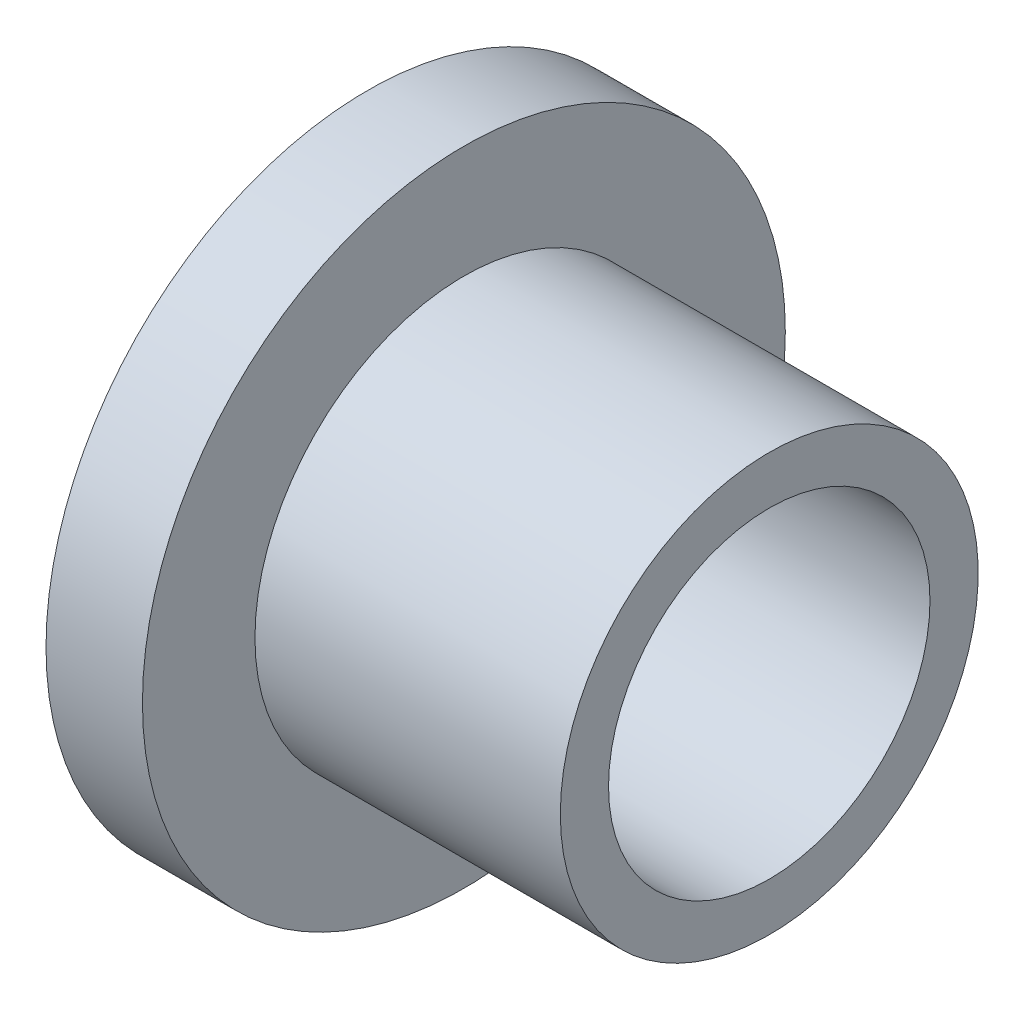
ISO-10303-21;
HEADER;
FILE_DESCRIPTION(('STEP AP214'),'2;1');
FILE_NAME('part.step','',(''),(''),'','','');
FILE_SCHEMA(('AUTOMOTIVE_DESIGN { 1 0 10303 214 1 1 1 1 }'));
ENDSEC;
DATA;
#1=APPLICATION_CONTEXT('core data for automotive mechanical design processes');
#2=APPLICATION_PROTOCOL_DEFINITION('international standard','automotive_design',2000,#1);
#3=PRODUCT_CONTEXT('',#1,'mechanical');
#4=PRODUCT('Part','Part','',(#3));
#5=PRODUCT_RELATED_PRODUCT_CATEGORY('part','',(#4));
#6=PRODUCT_DEFINITION_FORMATION('','',#4);
#7=PRODUCT_DEFINITION_CONTEXT('part definition',#1,'design');
#8=PRODUCT_DEFINITION('design','',#6,#7);
#9=PRODUCT_DEFINITION_SHAPE('','',#8);
#10=(LENGTH_UNIT() NAMED_UNIT(*) SI_UNIT(.MILLI.,.METRE.));
#11=(NAMED_UNIT(*) PLANE_ANGLE_UNIT() SI_UNIT($,.RADIAN.));
#12=(NAMED_UNIT(*) SI_UNIT($,.STERADIAN.) SOLID_ANGLE_UNIT());
#13=UNCERTAINTY_MEASURE_WITH_UNIT(LENGTH_MEASURE(1.E-05),#10,'distance_accuracy_value','');
#14=(GEOMETRIC_REPRESENTATION_CONTEXT(3) GLOBAL_UNCERTAINTY_ASSIGNED_CONTEXT((#13)) GLOBAL_UNIT_ASSIGNED_CONTEXT((#10,
#11,#12)) REPRESENTATION_CONTEXT('',''));
#15=CARTESIAN_POINT('',(0.,0.,0.));
#16=DIRECTION('',(0.,0.,1.));
#17=DIRECTION('',(1.,0.,0.));
#18=AXIS2_PLACEMENT_3D('',#15,#16,#17);
#19=CARTESIAN_POINT('',(0.,2.54,0.));
#20=DIRECTION('',(1.,0.,0.));
#21=DIRECTION('',(0.,1.,0.));
#22=AXIS2_PLACEMENT_3D('',#19,#20,#21);
#23=PLANE('',#22);
#24=CARTESIAN_POINT('',(0.,0.,0.));
#25=DIRECTION('',(-1.,0.,0.));
#26=DIRECTION('',(0.,0.,1.));
#27=AXIS2_PLACEMENT_3D('',#24,#25,#26);
#28=CIRCLE('',#27,2.54);
#29=CARTESIAN_POINT('',(0.,0.,2.54));
#30=VERTEX_POINT('',#29);
#31=EDGE_CURVE('E43',#30,#30,#28,.T.);
#32=ORIENTED_EDGE('',*,*,#31,.F.);
#33=EDGE_LOOP('',(#32));
#34=FACE_BOUND('',#33,.T.);
#35=CARTESIAN_POINT('',(0.,0.,0.));
#36=DIRECTION('',(-1.,0.,0.));
#37=DIRECTION('',(0.,0.,1.));
#38=AXIS2_PLACEMENT_3D('',#35,#36,#37);
#39=CIRCLE('',#38,5.08);
#40=CARTESIAN_POINT('',(0.,0.,5.08));
#41=VERTEX_POINT('',#40);
#42=EDGE_CURVE('E10',#41,#41,#39,.T.);
#43=ORIENTED_EDGE('',*,*,#42,.T.);
#44=EDGE_LOOP('',(#43));
#45=FACE_BOUND('',#44,.T.);
#46=ADVANCED_FACE('F15',(#34,#45),#23,.F.);
#47=CARTESIAN_POINT('',(6.35,3.302,0.));
#48=DIRECTION('',(-1.,0.,0.));
#49=DIRECTION('',(0.,0.,1.));
#50=AXIS2_PLACEMENT_3D('',#47,#48,#49);
#51=PLANE('',#50);
#52=CARTESIAN_POINT('',(6.35000000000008,0.,0.));
#53=DIRECTION('',(-1.,0.,0.));
#54=DIRECTION('',(0.,0.,1.));
#55=AXIS2_PLACEMENT_3D('',#52,#53,#54);
#56=CIRCLE('',#55,2.54);
#57=CARTESIAN_POINT('',(6.35000000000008,0.,2.54));
#58=VERTEX_POINT('',#57);
#59=EDGE_CURVE('E53',#58,#58,#56,.T.);
#60=ORIENTED_EDGE('',*,*,#59,.T.);
#61=EDGE_LOOP('',(#60));
#62=FACE_BOUND('',#61,.T.);
#63=CARTESIAN_POINT('',(6.35000000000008,0.,0.));
#64=DIRECTION('',(-1.,0.,0.));
#65=DIRECTION('',(0.,0.,1.));
#66=AXIS2_PLACEMENT_3D('',#63,#64,#65);
#67=CIRCLE('',#66,3.302);
#68=CARTESIAN_POINT('',(6.35000000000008,0.,3.302));
#69=VERTEX_POINT('',#68);
#70=EDGE_CURVE('E40',#69,#69,#67,.T.);
#71=ORIENTED_EDGE('',*,*,#70,.F.);
#72=EDGE_LOOP('',(#71));
#73=FACE_BOUND('',#72,.T.);
#74=ADVANCED_FACE('F64',(#62,#73),#51,.F.);
#75=CARTESIAN_POINT('',(1.524,5.08,0.));
#76=DIRECTION('',(-1.,0.,0.));
#77=DIRECTION('',(0.,0.,1.));
#78=AXIS2_PLACEMENT_3D('',#75,#76,#77);
#79=PLANE('',#78);
#80=CARTESIAN_POINT('',(1.52400000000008,0.,0.));
#81=DIRECTION('',(-1.,0.,0.));
#82=DIRECTION('',(0.,0.,1.));
#83=AXIS2_PLACEMENT_3D('',#80,#81,#82);
#84=CIRCLE('',#83,3.302);
#85=CARTESIAN_POINT('',(1.52400000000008,0.,3.302));
#86=VERTEX_POINT('',#85);
#87=EDGE_CURVE('E32',#86,#86,#84,.T.);
#88=ORIENTED_EDGE('',*,*,#87,.T.);
#89=EDGE_LOOP('',(#88));
#90=FACE_BOUND('',#89,.T.);
#91=CARTESIAN_POINT('',(1.52400000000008,0.,0.));
#92=DIRECTION('',(-1.,0.,0.));
#93=DIRECTION('',(0.,0.,1.));
#94=AXIS2_PLACEMENT_3D('',#91,#92,#93);
#95=CIRCLE('',#94,5.08);
#96=CARTESIAN_POINT('',(1.52400000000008,0.,5.08));
#97=VERTEX_POINT('',#96);
#98=EDGE_CURVE('E23',#97,#97,#95,.T.);
#99=ORIENTED_EDGE('',*,*,#98,.F.);
#100=EDGE_LOOP('',(#99));
#101=FACE_BOUND('',#100,.T.);
#102=ADVANCED_FACE('F17',(#90,#101),#79,.F.);
#103=CARTESIAN_POINT('',(-1000.,0.,0.));
#104=DIRECTION('',(-1.,0.,0.));
#105=DIRECTION('',(0.,0.,1.));
#106=AXIS2_PLACEMENT_3D('',#103,#104,#105);
#107=CYLINDRICAL_SURFACE('',#106,5.08);
#108=ORIENTED_EDGE('',*,*,#42,.F.);
#109=EDGE_LOOP('',(#108));
#110=FACE_BOUND('',#109,.T.);
#111=ORIENTED_EDGE('',*,*,#98,.T.);
#112=EDGE_LOOP('',(#111));
#113=FACE_BOUND('',#112,.T.);
#114=ADVANCED_FACE('F75',(#110,#113),#107,.T.);
#115=CARTESIAN_POINT('',(-1000.,0.,0.));
#116=DIRECTION('',(-1.,0.,0.));
#117=DIRECTION('',(0.,0.,1.));
#118=AXIS2_PLACEMENT_3D('',#115,#116,#117);
#119=CYLINDRICAL_SURFACE('',#118,3.302);
#120=ORIENTED_EDGE('',*,*,#87,.F.);
#121=EDGE_LOOP('',(#120));
#122=FACE_BOUND('',#121,.T.);
#123=ORIENTED_EDGE('',*,*,#70,.T.);
#124=EDGE_LOOP('',(#123));
#125=FACE_BOUND('',#124,.T.);
#126=ADVANCED_FACE('F69',(#122,#125),#119,.T.);
#127=CARTESIAN_POINT('',(-1000.,0.,0.));
#128=DIRECTION('',(-1.,0.,0.));
#129=DIRECTION('',(0.,0.,1.));
#130=AXIS2_PLACEMENT_3D('',#127,#128,#129);
#131=CYLINDRICAL_SURFACE('',#130,2.54);
#132=ORIENTED_EDGE('',*,*,#31,.T.);
#133=EDGE_LOOP('',(#132));
#134=FACE_BOUND('',#133,.T.);
#135=ORIENTED_EDGE('',*,*,#59,.F.);
#136=EDGE_LOOP('',(#135));
#137=FACE_BOUND('',#136,.T.);
#138=ADVANCED_FACE('F67',(#134,#137),#131,.F.);
#139=CLOSED_SHELL('',(#46,#74,#102,#114,#126,#138));
#140=MANIFOLD_SOLID_BREP('B1',#139);
#141=ADVANCED_BREP_SHAPE_REPRESENTATION('',(#18,#140),#14);
#142=SHAPE_DEFINITION_REPRESENTATION(#9,#141);
ENDSEC;
END-ISO-10303-21;
